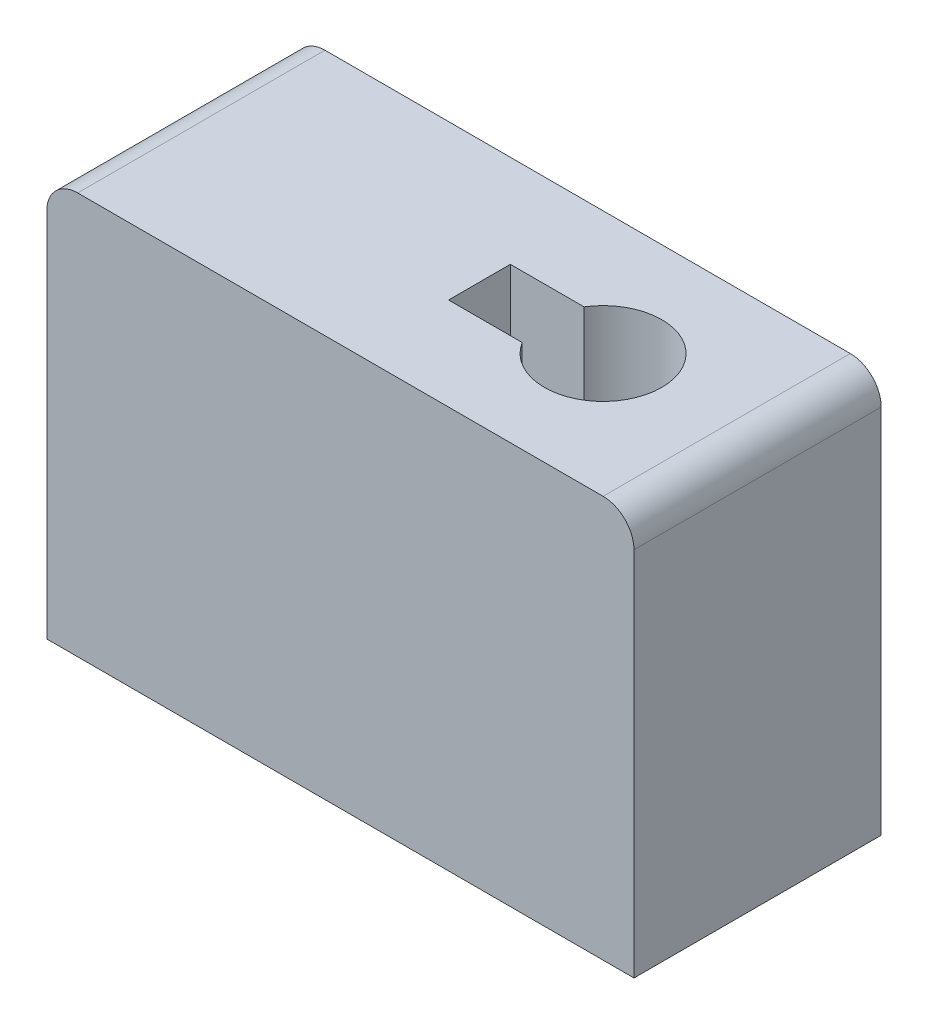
from build123d import *

# Parameters (mm, degrees)
SKETCH_1_W               = 19
SKETCH_1_H               = 8
SKETCH_1_R               = 2.7
EXTRUDE_1_DEPTH          = 10
SKETCH_2_W               = 19
SKETCH_2_H               = 8
SKETCH_2_R               = 1.9
EXTRUDE_2_DEPTH          = 3
FILLET_1_R               = 1
CUT_EXTRUDE_2_DEPTH      = 25.372115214
CUT_EXTRUDE_2_DEPTH_BACK = 25.372115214


with BuildPart() as part:
    # Sketch 1 → Extrude 1 (new body)
    with BuildSketch(Plane(origin=(0, 0, 0), x_dir=(1, 0, 0), z_dir=(0, 1, 0))):
        with Locations((9.5, 4)):
            Rectangle(SKETCH_1_W, SKETCH_1_H)
        with Locations(Location((5, 4, 0), (0, 0, 270))):
            Circle(SKETCH_1_R, mode=Mode.SUBTRACT)
        with Locations(Location((14, 4, 0), (0, 0, 270))):
            Circle(SKETCH_1_R, mode=Mode.SUBTRACT)
    extrude(amount=EXTRUDE_1_DEPTH)

    # Sketch 2 → Extrude 2 (add)
    with BuildSketch(Plane(origin=(0, 10, 0), x_dir=(1, 0, 0), z_dir=(0, 1, 0))):
        with Locations((9.5, 4)):
            Rectangle(SKETCH_2_W, SKETCH_2_H)
        with Locations(Location((14, 4, 0), (0, 0, 270))):
            Circle(SKETCH_2_R, mode=Mode.SUBTRACT)
    extrude(amount=EXTRUDE_2_DEPTH)

    # Fillet 1
    fillet_1_edges = [part.edges().sort_by_distance(p)[0] for p in [
        (0, 13, -4),
        (19, 13, -4),
    ]]
    fillet(fillet_1_edges, radius=FILLET_1_R)

    # Sketch 3 → Cut-Extrude 2 (cut, two sides: drawn at the far end of the back side and taken through both)
    with BuildSketch(Plane(origin=(0, 13, 0), x_dir=(1, 0, 0), z_dir=(0, 1, 0)).offset(-CUT_EXTRUDE_2_DEPTH_BACK)):
        with BuildLine():
            ThreePointArc((12.384450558, 3), (12.1, 4), (12.384450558, 5))
            Line((12.384450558, 5), (10, 5))
            Line((10, 5), (10, 3))
            Line((10, 3), (12.384450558, 3))
        make_face()
    extrude(amount=CUT_EXTRUDE_2_DEPTH + CUT_EXTRUDE_2_DEPTH_BACK, mode=Mode.SUBTRACT)


solid = part.part
